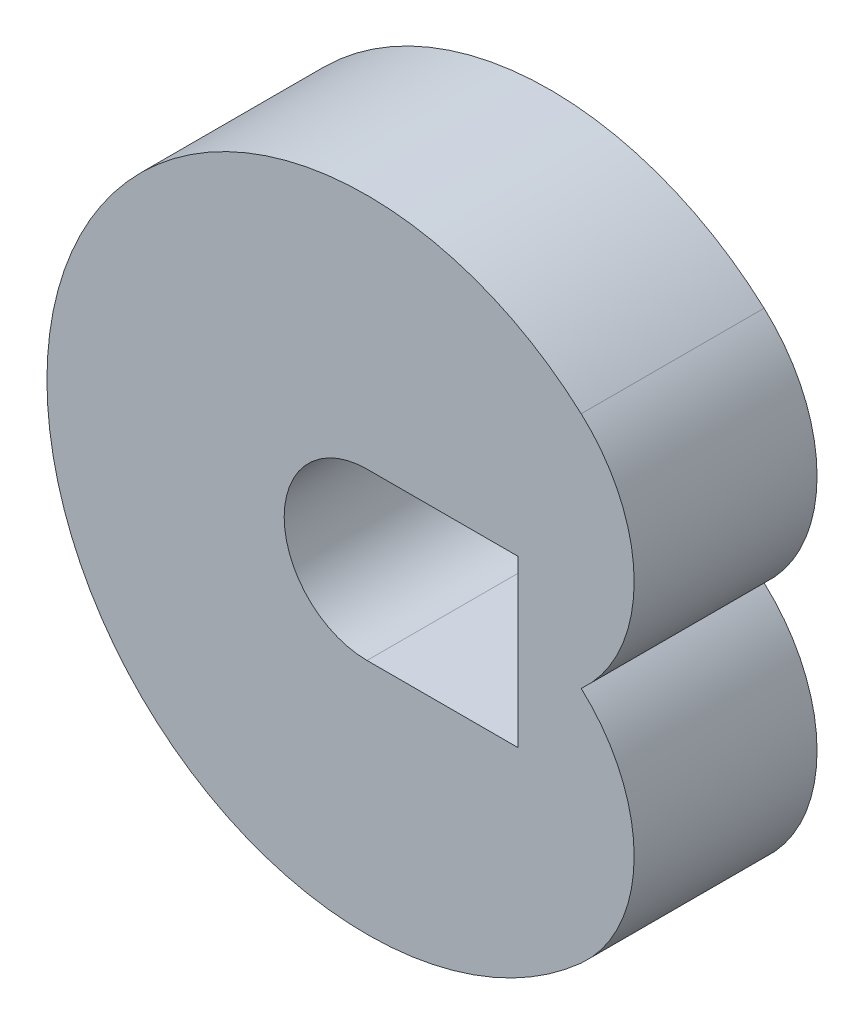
from build123d import *

# Parameters (mm, degrees)
EXTRUDE_1_DEPTH = 400


with BuildPart() as part:
    # Sketch 1 → Extrude 1 (new body)
    with BuildSketch(Plane.XY):
        with BuildLine():
            ThreePointArc((468.391424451, 520.201377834), (-700, 0), (468.391424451, -520.201377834))
            ThreePointArc((468.391424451, -520.201377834), (584.195712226, -260.100688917), (468.391424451, 0))
            ThreePointArc((468.391424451, 0), (584.195712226, 260.100688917), (468.391424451, 520.201377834))
        make_face()
        with BuildLine():
            Line((0, 181.173331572), (330, 181.173331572))
            Line((330, 181.173331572), (330, -181.173331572))
            Line((330, -181.173331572), (0, -181.173331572))
            ThreePointArc((0, -181.173331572), (-181.173331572, 0), (0, 181.173331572))
        make_face(mode=Mode.SUBTRACT)
    extrude(amount=EXTRUDE_1_DEPTH)


solid = part.part
